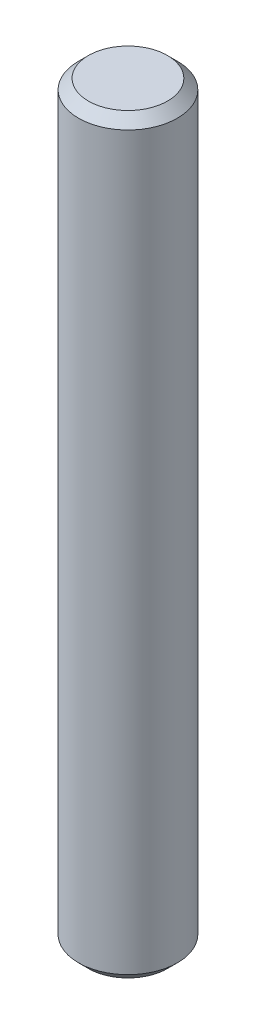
ISO-10303-21;
HEADER;
FILE_DESCRIPTION(('STEP AP214'),'2;1');
FILE_NAME('part.step','',(''),(''),'','','');
FILE_SCHEMA(('AUTOMOTIVE_DESIGN { 1 0 10303 214 1 1 1 1 }'));
ENDSEC;
DATA;
#1=APPLICATION_CONTEXT('core data for automotive mechanical design processes');
#2=APPLICATION_PROTOCOL_DEFINITION('international standard','automotive_design',2000,#1);
#3=PRODUCT_CONTEXT('',#1,'mechanical');
#4=PRODUCT('Part','Part','',(#3));
#5=PRODUCT_RELATED_PRODUCT_CATEGORY('part','',(#4));
#6=PRODUCT_DEFINITION_FORMATION('','',#4);
#7=PRODUCT_DEFINITION_CONTEXT('part definition',#1,'design');
#8=PRODUCT_DEFINITION('design','',#6,#7);
#9=PRODUCT_DEFINITION_SHAPE('','',#8);
#10=(LENGTH_UNIT() NAMED_UNIT(*) SI_UNIT(.MILLI.,.METRE.));
#11=(NAMED_UNIT(*) PLANE_ANGLE_UNIT() SI_UNIT($,.RADIAN.));
#12=(NAMED_UNIT(*) SI_UNIT($,.STERADIAN.) SOLID_ANGLE_UNIT());
#13=UNCERTAINTY_MEASURE_WITH_UNIT(LENGTH_MEASURE(1.E-05),#10,'distance_accuracy_value','');
#14=(GEOMETRIC_REPRESENTATION_CONTEXT(3) GLOBAL_UNCERTAINTY_ASSIGNED_CONTEXT((#13)) GLOBAL_UNIT_ASSIGNED_CONTEXT((#10,
#11,#12)) REPRESENTATION_CONTEXT('',''));
#15=CARTESIAN_POINT('',(0.,0.,0.));
#16=DIRECTION('',(0.,0.,1.));
#17=DIRECTION('',(1.,0.,0.));
#18=AXIS2_PLACEMENT_3D('',#15,#16,#17);
#19=CARTESIAN_POINT('',(0.,38.,0.));
#20=DIRECTION('',(0.,-1.,0.));
#21=DIRECTION('',(0.,0.,-1.));
#22=AXIS2_PLACEMENT_3D('',#19,#20,#21);
#23=CYLINDRICAL_SURFACE('',#22,2.5);
#24=CARTESIAN_POINT('',(0.,0.499999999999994,0.));
#25=DIRECTION('',(0.,1.,0.));
#26=DIRECTION('',(0.,0.,1.));
#27=AXIS2_PLACEMENT_3D('',#24,#25,#26);
#28=CIRCLE('',#27,2.5);
#29=CARTESIAN_POINT('',(0.,0.499999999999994,2.5));
#30=VERTEX_POINT('',#29);
#31=EDGE_CURVE('E36',#30,#30,#28,.T.);
#32=ORIENTED_EDGE('',*,*,#31,.T.);
#33=EDGE_LOOP('',(#32));
#34=FACE_BOUND('',#33,.T.);
#35=CARTESIAN_POINT('',(0.,37.5,0.));
#36=DIRECTION('',(0.,1.,0.));
#37=DIRECTION('',(0.,0.,1.));
#38=AXIS2_PLACEMENT_3D('',#35,#36,#37);
#39=CIRCLE('',#38,2.5);
#40=CARTESIAN_POINT('',(0.,37.5,2.5));
#41=VERTEX_POINT('',#40);
#42=EDGE_CURVE('E40',#41,#41,#39,.F.);
#43=ORIENTED_EDGE('',*,*,#42,.T.);
#44=EDGE_LOOP('',(#43));
#45=FACE_BOUND('',#44,.T.);
#46=ADVANCED_FACE('F30',(#34,#45),#23,.T.);
#47=CARTESIAN_POINT('',(0.,38.,0.));
#48=DIRECTION('',(0.,1.,0.));
#49=DIRECTION('',(0.,0.,1.));
#50=AXIS2_PLACEMENT_3D('',#47,#48,#49);
#51=PLANE('',#50);
#52=CARTESIAN_POINT('',(0.,38.,0.));
#53=DIRECTION('',(0.,1.,0.));
#54=DIRECTION('',(0.,0.,1.));
#55=AXIS2_PLACEMENT_3D('',#52,#53,#54);
#56=CIRCLE('',#55,1.99999999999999);
#57=CARTESIAN_POINT('',(0.,38.,1.99999999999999));
#58=VERTEX_POINT('',#57);
#59=EDGE_CURVE('E44',#58,#58,#56,.T.);
#60=ORIENTED_EDGE('',*,*,#59,.T.);
#61=EDGE_LOOP('',(#60));
#62=FACE_BOUND('',#61,.T.);
#63=ADVANCED_FACE('F50',(#62),#51,.T.);
#64=CARTESIAN_POINT('',(0.,0.,0.));
#65=DIRECTION('',(0.,1.,0.));
#66=DIRECTION('',(0.,0.,1.));
#67=AXIS2_PLACEMENT_3D('',#64,#65,#66);
#68=PLANE('',#67);
#69=CARTESIAN_POINT('',(0.,0.,0.));
#70=DIRECTION('',(0.,1.,0.));
#71=DIRECTION('',(0.,0.,1.));
#72=AXIS2_PLACEMENT_3D('',#69,#70,#71);
#73=CIRCLE('',#72,2.00000000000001);
#74=CARTESIAN_POINT('',(0.,0.,2.00000000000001));
#75=VERTEX_POINT('',#74);
#76=EDGE_CURVE('E10',#75,#75,#73,.F.);
#77=ORIENTED_EDGE('',*,*,#76,.T.);
#78=EDGE_LOOP('',(#77));
#79=FACE_BOUND('',#78,.T.);
#80=ADVANCED_FACE('F55',(#79),#68,.F.);
#81=CARTESIAN_POINT('',(0.,38.,0.));
#82=DIRECTION('',(0.,-1.,0.));
#83=DIRECTION('',(0.,0.,-1.));
#84=AXIS2_PLACEMENT_3D('',#81,#82,#83);
#85=CONICAL_SURFACE('',#84,1.99999999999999,0.78539816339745);
#86=ORIENTED_EDGE('',*,*,#42,.F.);
#87=EDGE_LOOP('',(#86));
#88=FACE_BOUND('',#87,.T.);
#89=ORIENTED_EDGE('',*,*,#59,.F.);
#90=EDGE_LOOP('',(#89));
#91=FACE_BOUND('',#90,.T.);
#92=ADVANCED_FACE('F52',(#88,#91),#85,.T.);
#93=CARTESIAN_POINT('',(0.,0.499999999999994,0.));
#94=DIRECTION('',(0.,1.,0.));
#95=DIRECTION('',(0.,0.,1.));
#96=AXIS2_PLACEMENT_3D('',#93,#94,#95);
#97=CONICAL_SURFACE('',#96,2.5,0.78539816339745);
#98=ORIENTED_EDGE('',*,*,#76,.F.);
#99=EDGE_LOOP('',(#98));
#100=FACE_BOUND('',#99,.T.);
#101=ORIENTED_EDGE('',*,*,#31,.F.);
#102=EDGE_LOOP('',(#101));
#103=FACE_BOUND('',#102,.T.);
#104=ADVANCED_FACE('F54',(#100,#103),#97,.T.);
#105=CLOSED_SHELL('',(#46,#63,#80,#92,#104));
#106=MANIFOLD_SOLID_BREP('B2',#105);
#107=ADVANCED_BREP_SHAPE_REPRESENTATION('',(#18,#106),#14);
#108=SHAPE_DEFINITION_REPRESENTATION(#9,#107);
ENDSEC;
END-ISO-10303-21;
